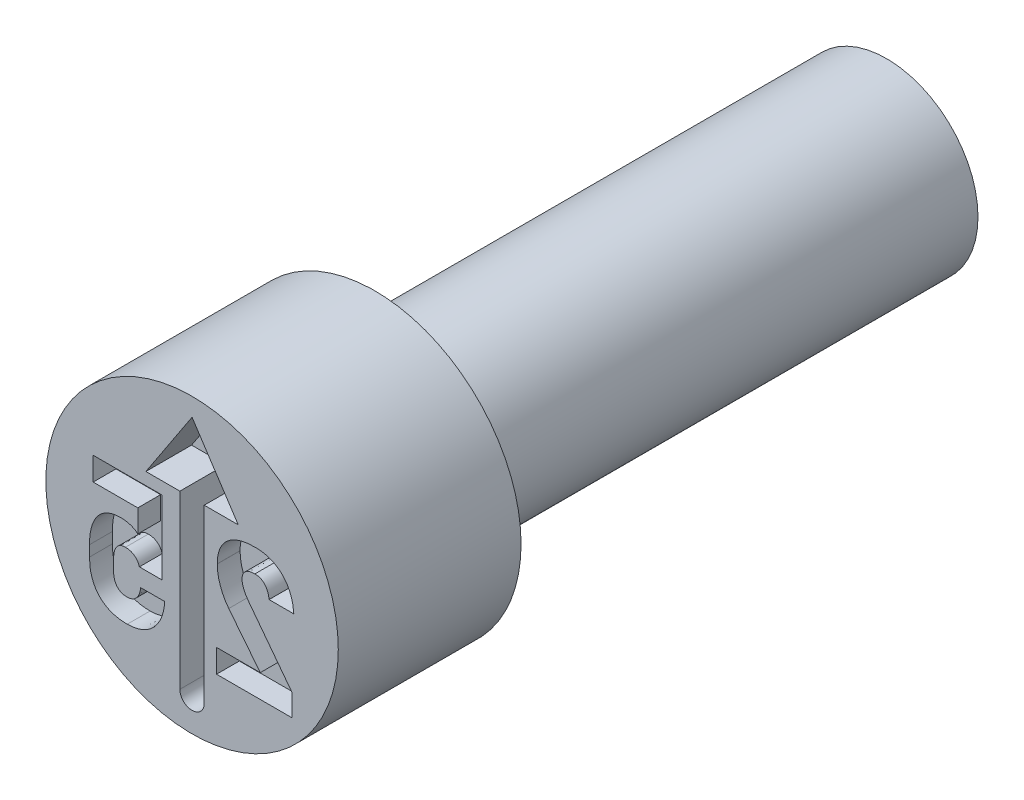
from build123d import *

# Parameters (mm, degrees)
CUT_EXTRUDE4_DEPTH = 0.25
CUT_EXTRUDE5_DEPTH = 0.125


with BuildPart() as part:
    # Sketch2 → Revolve1 (revolve)
    with BuildSketch(Plane(origin=(0, 0, 0), x_dir=(0, 0, -1), z_dir=(1, 0, 0)), mode=Mode.PRIVATE) as revolve1_sk:
        Polygon((0, 0.8), (0, 0), (3.8, 0), (3.8, 0.5), (1, 0.5), (1, 0.8), align=None)
    revolve(revolve1_sk.sketch.rotate(Axis((0, 0, -0.403888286), (0, 0, -1)), 90), axis=Axis((0, 0, -0.403888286), (0, 0, -1)))

    # Sketch3 → Cut-Extrude4 (cut)
    with BuildSketch(Plane.XY):
        with BuildLine():
            Line((0.066665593, 0.317223), (0.066665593, -0.621656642))
            ThreePointArc((0.066665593, -0.621656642), (0, -0.688322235), (-0.066665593, -0.621656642))
            Line((-0.066665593, -0.621656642), (-0.066665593, 0.317223))
            Line((-0.066665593, 0.317223), (-0.252671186, 0.317223))
            Line((-0.252671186, 0.317223), (0, 0.700740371))
            Line((0, 0.700740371), (0.252671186, 0.317223))
            Line((0.252671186, 0.317223), (0.066665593, 0.317223))
        make_face()
    extrude(amount=-CUT_EXTRUDE4_DEPTH, mode=Mode.SUBTRACT)

    # Sketch4 → Cut-Extrude5 (cut)
    with BuildSketch(Plane.XY):
        with BuildLine():
            Line((0.547931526, -0.331027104), (0.307703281, -0.015192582))
            add(Edge.make_bspline(
                [(0.307703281, -0.015192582), (0.302665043, -0.008202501), (0.292829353, 0.005443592), (0.28402945, 0.024265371), (0.278439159, 0.039023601), (0.27585465, 0.049728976), (0.273941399, 0.059965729), (0.273718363, 0.066682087), (0.27360913, 0.069971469)],
                knots=[0, 0, 0, 0, 1.660423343, 3.241491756, 3.993801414, 4.704207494, 5.365376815, 6, 6, 6, 6], degree=3))
            add(Edge.make_bspline(
                [(0.27360913, 0.069971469), (0.273800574, 0.075464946), (0.274165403, 0.084030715), (0.277687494, 0.096081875), (0.283511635, 0.106502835), (0.291669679, 0.115238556), (0.30204676, 0.12195236), (0.314287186, 0.126856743), (0.328456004, 0.129631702), (0.338504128, 0.129985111), (0.343794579, 0.130171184)],
                knots=[0, 0, 0, 0, 1.033361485, 1.969238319, 2.861873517, 3.760870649, 4.693536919, 5.686153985, 6.781734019, 8, 8, 8, 8], degree=3))
            add(Edge.make_bspline(
                [(0.343794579, 0.130171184), (0.349004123, 0.129951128), (0.359114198, 0.12952407), (0.373495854, 0.12545463), (0.386271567, 0.118545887), (0.397331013, 0.108997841), (0.40661089, 0.096986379), (0.41345085, 0.08251648), (0.418959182, 0.066070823), (0.420557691, 0.054134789), (0.421398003, 0.0478602)],
                knots=[0, 0, 0, 0, 0.993701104, 1.928459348, 2.826878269, 3.748294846, 4.700551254, 5.70417143, 6.793118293, 8, 8, 8, 8], degree=3))
            Line((0.421398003, 0.0478602), (0.556633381, 0.047289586))
            add(Edge.make_bspline(
                [(0.556633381, 0.047289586), (0.555664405, 0.058398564), (0.553776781, 0.078927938), (0.547358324, 0.108450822), (0.537876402, 0.135616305), (0.525761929, 0.160499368), (0.510907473, 0.182785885), (0.493671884, 0.202469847), (0.473864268, 0.219168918), (0.45182772, 0.233045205), (0.42765849, 0.243904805), (0.401652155, 0.251817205), (0.373769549, 0.256378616), (0.354605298, 0.256971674), (0.344793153, 0.257275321)],
                knots=[0, 0, 0, 0, 1.143950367, 2.228484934, 3.258162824, 4.249580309, 5.213917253, 6.146796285, 7.070112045, 8.006232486, 8.954636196, 9.927630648, 10.9389416, 12, 12, 12, 12], degree=3))
            add(Edge.make_bspline(
                [(0.344793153, 0.257275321), (0.334271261, 0.257055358), (0.313906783, 0.256629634), (0.284583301, 0.252621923), (0.257619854, 0.245952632), (0.233084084, 0.236582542), (0.211137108, 0.224537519), (0.191677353, 0.210240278), (0.175254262, 0.193135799), (0.161593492, 0.173704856), (0.150824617, 0.152022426), (0.14328321, 0.12810721), (0.138664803, 0.10215131), (0.138096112, 0.084113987), (0.137803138, 0.074821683)],
                knots=[0, 0, 0, 0, 1.208591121, 2.339154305, 3.392741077, 4.394302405, 5.348037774, 6.261656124, 7.158186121, 8.060194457, 8.981460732, 9.928425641, 10.932785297, 12, 12, 12, 12], degree=3))
            add(Edge.make_bspline(
                [(0.137803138, 0.074821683), (0.137986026, 0.066300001), (0.138352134, 0.050383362), (0.141617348, 0.026604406), (0.146956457, 0.002962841), (0.154200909, -0.020458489), (0.163247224, -0.043268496), (0.17404338, -0.0651037), (0.18636933, -0.085908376), (0.196027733, -0.098774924), (0.20085592, -0.105206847)],
                knots=[0, 0, 0, 0, 0.985191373, 1.972179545, 2.968870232, 3.986806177, 5.007996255, 6.007036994, 7.003727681, 8, 8, 8, 8], degree=3))
            Line((0.20085592, -0.105206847), (0.37318117, -0.322895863))
            Line((0.37318117, -0.322895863), (0.133951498, -0.322895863))
            Line((0.133951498, -0.322895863), (0.133951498, -0.45))
            Line((0.133951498, -0.45), (0.547931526, -0.45))
            Line((0.547931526, -0.45), (0.547931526, -0.331027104))
        make_face()
        with BuildLine():
            add(Edge.make_bspline(
                [(-0.354687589, -0.457275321), (-0.345487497, -0.45699464), (-0.327484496, -0.456445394), (-0.301242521, -0.451514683), (-0.276364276, -0.443878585), (-0.253034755, -0.43298517), (-0.231507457, -0.419145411), (-0.212258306, -0.402221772), (-0.195110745, -0.382657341), (-0.180408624, -0.360280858), (-0.168300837, -0.335331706), (-0.158874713, -0.308103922), (-0.152400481, -0.278646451), (-0.150518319, -0.258209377), (-0.149552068, -0.247717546)],
                knots=[0, 0, 0, 0, 1.013165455, 1.982590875, 2.932437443, 3.87502652, 4.811241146, 5.743574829, 6.690699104, 7.67044025, 8.68537997, 9.739549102, 10.839546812, 12, 12, 12, 12], degree=3))
            Line((-0.149552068, -0.247717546), (-0.281506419, -0.247289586))
            add(Edge.make_bspline(
                [(-0.281506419, -0.247289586), (-0.282259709, -0.253844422), (-0.283695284, -0.265520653), (-0.288871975, -0.281723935), (-0.295630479, -0.295966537), (-0.304557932, -0.307917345), (-0.315159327, -0.317619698), (-0.327721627, -0.324200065), (-0.341605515, -0.328591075), (-0.35146626, -0.32897499), (-0.356542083, -0.329172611)],
                knots=[0, 0, 0, 0, 1.202223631, 2.291125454, 3.30376979, 4.265156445, 5.185306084, 6.082185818, 7.012804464, 8, 8, 8, 8], degree=3))
            add(Edge.make_bspline(
                [(-0.356542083, -0.329172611), (-0.362043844, -0.328932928), (-0.372567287, -0.328474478), (-0.387317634, -0.324049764), (-0.400158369, -0.31696577), (-0.410764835, -0.306772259), (-0.419226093, -0.294071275), (-0.425215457, -0.278861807), (-0.428762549, -0.26138523), (-0.429111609, -0.248971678), (-0.429295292, -0.242439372)],
                knots=[0, 0, 0, 0, 1.026088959, 1.96264217, 2.850204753, 3.743092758, 4.68486217, 5.681854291, 6.780136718, 8, 8, 8, 8], degree=3))
            Line((-0.429295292, -0.242439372), (-0.429295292, -0.183808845))
            add(Edge.make_bspline(
                [(-0.429295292, -0.183808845), (-0.429154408, -0.177276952), (-0.428887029, -0.16488037), (-0.425560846, -0.147539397), (-0.420389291, -0.132409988), (-0.412751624, -0.119850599), (-0.403257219, -0.109713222), (-0.391767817, -0.102513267), (-0.378514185, -0.098260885), (-0.369127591, -0.097762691), (-0.364245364, -0.097503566)],
                knots=[0, 0, 0, 0, 1.281587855, 2.432267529, 3.454745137, 4.406485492, 5.298532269, 6.159104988, 7.042499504, 8, 8, 8, 8], degree=3))
            add(Edge.make_bspline(
                [(-0.364245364, -0.097503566), (-0.359665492, -0.097643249), (-0.350799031, -0.09791367), (-0.338032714, -0.100713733), (-0.326299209, -0.105295), (-0.315731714, -0.111772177), (-0.306398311, -0.11971075), (-0.298713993, -0.129303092), (-0.292272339, -0.140141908), (-0.289584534, -0.148271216), (-0.288211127, -0.152425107)],
                knots=[0, 0, 0, 0, 1.085085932, 2.100686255, 3.083167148, 4.060192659, 5.028057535, 5.974180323, 6.964852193, 8, 8, 8, 8], degree=3))
            Line((-0.288211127, -0.152425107), (-0.164958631, -0.152425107))
            Line((-0.164958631, -0.152425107), (-0.164958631, 0.25))
            Line((-0.164958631, 0.25), (-0.540992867, 0.25))
            Line((-0.540992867, 0.25), (-0.540992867, 0.122895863))
            Line((-0.540992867, 0.122895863), (-0.296912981, 0.122895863))
            Line((-0.296912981, 0.122895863), (-0.296912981, -0.000784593))
            add(Edge.make_bspline(
                [(-0.296912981, -0.000784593), (-0.299568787, 0.001567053), (-0.305031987, 0.006404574), (-0.314583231, 0.012546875), (-0.325506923, 0.017763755), (-0.341625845, 0.023772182), (-0.362829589, 0.029115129), (-0.38023638, 0.030014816), (-0.38878174, 0.030456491)],
                knots=[0, 0, 0, 0, 0.643749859, 1.324243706, 2.054464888, 2.839075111, 4.448235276, 6, 6, 6, 6], degree=3))
            add(Edge.make_bspline(
                [(-0.38878174, 0.030456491), (-0.397554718, 0.030178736), (-0.414569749, 0.029640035), (-0.439112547, 0.024794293), (-0.461731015, 0.017030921), (-0.482238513, 0.005846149), (-0.500658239, -0.008172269), (-0.516657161, -0.025301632), (-0.530335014, -0.045262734), (-0.541529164, -0.068068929), (-0.550339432, -0.09352037), (-0.556738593, -0.121439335), (-0.560385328, -0.151852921), (-0.560860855, -0.172909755), (-0.56110699, -0.183808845)],
                knots=[0, 0, 0, 0, 1.012739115, 1.964189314, 2.878178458, 3.765675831, 4.65138573, 5.541464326, 6.461953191, 7.437418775, 8.467828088, 9.567356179, 10.740855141, 12, 12, 12, 12], degree=3))
            Line((-0.56110699, -0.183808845), (-0.56110699, -0.242439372))
            add(Edge.make_bspline(
                [(-0.56110699, -0.242439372), (-0.560794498, -0.25334166), (-0.560189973, -0.274432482), (-0.555866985, -0.304931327), (-0.54807386, -0.332907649), (-0.53763222, -0.358542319), (-0.523997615, -0.381325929), (-0.507670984, -0.401450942), (-0.488354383, -0.418452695), (-0.466503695, -0.432761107), (-0.44191101, -0.443734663), (-0.414969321, -0.451706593), (-0.385572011, -0.456448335), (-0.365214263, -0.45699345), (-0.354687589, -0.457275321)],
                knots=[0, 0, 0, 0, 1.159103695, 2.242322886, 3.265299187, 4.239894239, 5.17631577, 6.078070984, 6.98412447, 7.901225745, 8.844758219, 9.836512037, 10.881294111, 12, 12, 12, 12], degree=3))
        make_face()
    extrude(amount=-CUT_EXTRUDE5_DEPTH, mode=Mode.SUBTRACT)


solid = part.part
